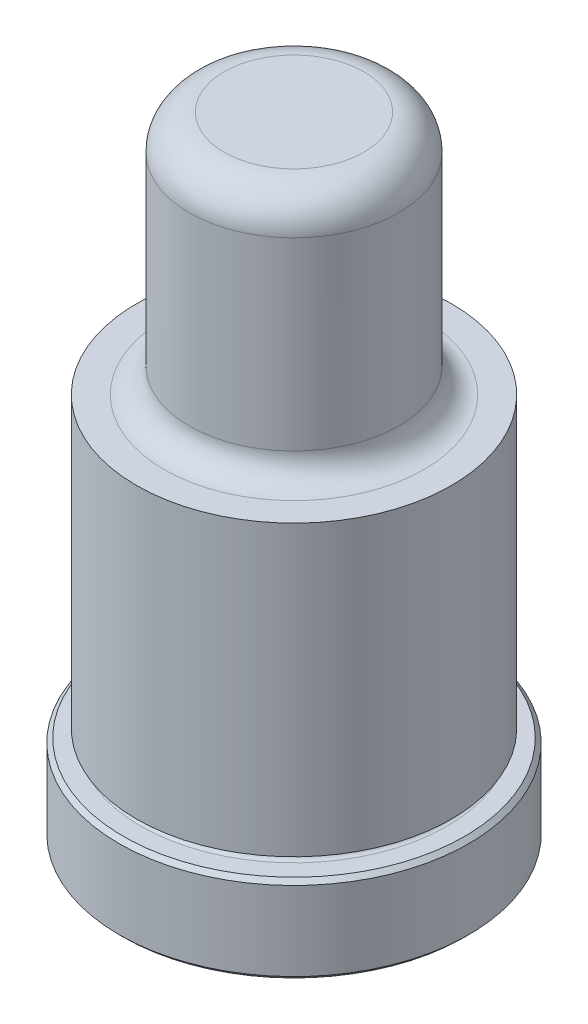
from build123d import *

# Parameters (mm, degrees)
CHAMFER1_SIZE = 0.381
FILLET1_R     = 3.175


with BuildPart() as part:
    # Sketch1 → Revolve1 (revolve)
    with BuildSketch(Plane(origin=(0, 0, 0), x_dir=(0, 0, -1), z_dir=(1, 0, 0)), mode=Mode.PRIVATE) as revolve1_sk:
        with BuildLine():
            Line((0, 0), (15.875, 0))
            Line((15.875, 0), (15.875, 7.9248))
            Line((15.875, 7.9248), (13.8938, 7.9248))
            ThreePointArc((13.8938, 7.9248), (13.5128, 8.3058), (13.8938, 8.6868))
            Line((13.8938, 8.6868), (14.3002, 8.6868))
            Line((14.3002, 8.6868), (14.3002, 34.925))
            Line((14.3002, 34.925), (11.7983, 34.925))
            ThreePointArc((11.7983, 34.925), (10.181853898, 35.594553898), (9.5123, 37.211))
            Line((9.5123, 37.211), (9.5123, 57.15))
            Line((9.5123, 57.15), (0, 57.15))
            Line((0, 57.15), (0, 0))
        make_face()
    revolve(revolve1_sk.sketch.rotate(Axis((0, 0, 0), (0, -1, 0)), 180), axis=Axis((0, 0, 0), (0, -1, 0)))

    # Chamfer1
    chamfer1_edges = [part.edges().sort_by_distance(p)[0] for p in [
        (0, 7.9248, -15.875),
        (0, 0, -15.875),
    ]]
    chamfer(chamfer1_edges, length=CHAMFER1_SIZE)

    # Fillet1
    fillet1_edges = [part.edges().sort_by_distance(p)[0] for p in [
        (0, 57.15, -9.5123),
    ]]
    fillet(fillet1_edges, radius=FILLET1_R)


solid = part.part
